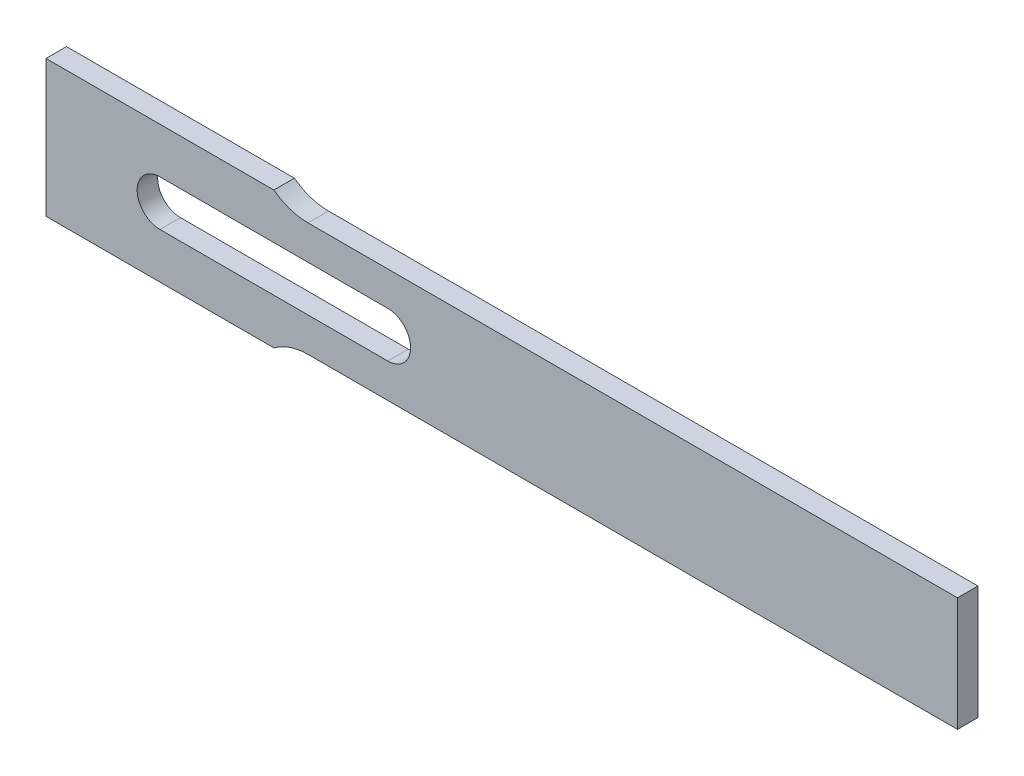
ISO-10303-21;
HEADER;
FILE_DESCRIPTION(('STEP AP214'),'2;1');
FILE_NAME('part.step','',(''),(''),'','','');
FILE_SCHEMA(('AUTOMOTIVE_DESIGN { 1 0 10303 214 1 1 1 1 }'));
ENDSEC;
DATA;
#1=APPLICATION_CONTEXT('core data for automotive mechanical design processes');
#2=APPLICATION_PROTOCOL_DEFINITION('international standard','automotive_design',2000,#1);
#3=PRODUCT_CONTEXT('',#1,'mechanical');
#4=PRODUCT('Part','Part','',(#3));
#5=PRODUCT_RELATED_PRODUCT_CATEGORY('part','',(#4));
#6=PRODUCT_DEFINITION_FORMATION('','',#4);
#7=PRODUCT_DEFINITION_CONTEXT('part definition',#1,'design');
#8=PRODUCT_DEFINITION('design','',#6,#7);
#9=PRODUCT_DEFINITION_SHAPE('','',#8);
#10=(LENGTH_UNIT() NAMED_UNIT(*) SI_UNIT(.MILLI.,.METRE.));
#11=(NAMED_UNIT(*) PLANE_ANGLE_UNIT() SI_UNIT($,.RADIAN.));
#12=(NAMED_UNIT(*) SI_UNIT($,.STERADIAN.) SOLID_ANGLE_UNIT());
#13=UNCERTAINTY_MEASURE_WITH_UNIT(LENGTH_MEASURE(1.E-05),#10,'distance_accuracy_value','');
#14=(GEOMETRIC_REPRESENTATION_CONTEXT(3) GLOBAL_UNCERTAINTY_ASSIGNED_CONTEXT((#13)) GLOBAL_UNIT_ASSIGNED_CONTEXT((#10,
#11,#12)) REPRESENTATION_CONTEXT('',''));
#15=CARTESIAN_POINT('',(0.,0.,0.));
#16=DIRECTION('',(0.,0.,1.));
#17=DIRECTION('',(1.,0.,0.));
#18=AXIS2_PLACEMENT_3D('',#15,#16,#17);
#19=CARTESIAN_POINT('',(23.,9.99999999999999,1.8));
#20=DIRECTION('',(0.,0.,1.));
#21=DIRECTION('',(1.,0.,0.));
#22=AXIS2_PLACEMENT_3D('',#19,#20,#21);
#23=PLANE('',#22);
#24=DIRECTION('',(0.,-1.,0.));
#25=VECTOR('',#24,1.);
#26=CARTESIAN_POINT('',(0.,-6.,1.8));
#27=LINE('',#26,#25);
#28=CARTESIAN_POINT('',(0.,6.,1.8));
#29=VERTEX_POINT('',#28);
#30=CARTESIAN_POINT('',(0.,-6.,1.8));
#31=VERTEX_POINT('',#30);
#32=EDGE_CURVE('E156',#29,#31,#27,.T.);
#33=ORIENTED_EDGE('',*,*,#32,.T.);
#34=DIRECTION('',(1.,0.,0.));
#35=VECTOR('',#34,1.);
#36=CARTESIAN_POINT('',(0.,-6.,1.8));
#37=LINE('',#36,#35);
#38=CARTESIAN_POINT('',(20.,-6.,1.8));
#39=VERTEX_POINT('',#38);
#40=EDGE_CURVE('E159',#31,#39,#37,.T.);
#41=ORIENTED_EDGE('',*,*,#40,.T.);
#42=CARTESIAN_POINT('',(23.,-9.99999999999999,1.8));
#43=DIRECTION('',(0.,0.,-1.));
#44=DIRECTION('',(1.,0.,0.));
#45=AXIS2_PLACEMENT_3D('',#42,#43,#44);
#46=CIRCLE('',#45,4.99999999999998);
#47=CARTESIAN_POINT('',(23.,-5.00000000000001,1.8));
#48=VERTEX_POINT('',#47);
#49=EDGE_CURVE('E162',#39,#48,#46,.T.);
#50=ORIENTED_EDGE('',*,*,#49,.T.);
#51=DIRECTION('',(1.,0.,0.));
#52=VECTOR('',#51,1.);
#53=CARTESIAN_POINT('',(80.,-5.00000000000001,1.8));
#54=LINE('',#53,#52);
#55=CARTESIAN_POINT('',(80.,-5.00000000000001,1.8));
#56=VERTEX_POINT('',#55);
#57=EDGE_CURVE('E164',#48,#56,#54,.T.);
#58=ORIENTED_EDGE('',*,*,#57,.T.);
#59=DIRECTION('',(0.,1.,0.));
#60=VECTOR('',#59,1.);
#61=CARTESIAN_POINT('',(80.,-5.00000000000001,1.8));
#62=LINE('',#61,#60);
#63=CARTESIAN_POINT('',(80.,4.99999999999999,1.8));
#64=VERTEX_POINT('',#63);
#65=EDGE_CURVE('E166',#56,#64,#62,.T.);
#66=ORIENTED_EDGE('',*,*,#65,.T.);
#67=DIRECTION('',(-1.,0.,0.));
#68=VECTOR('',#67,1.);
#69=CARTESIAN_POINT('',(80.,4.99999999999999,1.8));
#70=LINE('',#69,#68);
#71=CARTESIAN_POINT('',(23.,4.99999999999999,1.8));
#72=VERTEX_POINT('',#71);
#73=EDGE_CURVE('E168',#64,#72,#70,.T.);
#74=ORIENTED_EDGE('',*,*,#73,.T.);
#75=CARTESIAN_POINT('',(23.,9.99999999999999,1.8));
#76=DIRECTION('',(0.,0.,-1.));
#77=DIRECTION('',(1.,0.,0.));
#78=AXIS2_PLACEMENT_3D('',#75,#76,#77);
#79=CIRCLE('',#78,5.);
#80=CARTESIAN_POINT('',(20.,6.,1.8));
#81=VERTEX_POINT('',#80);
#82=EDGE_CURVE('E170',#72,#81,#79,.T.);
#83=ORIENTED_EDGE('',*,*,#82,.T.);
#84=DIRECTION('',(-1.,0.,0.));
#85=VECTOR('',#84,1.);
#86=CARTESIAN_POINT('',(0.,6.,1.8));
#87=LINE('',#86,#85);
#88=EDGE_CURVE('E172',#81,#29,#87,.T.);
#89=ORIENTED_EDGE('',*,*,#88,.T.);
#90=EDGE_LOOP('',(#33,#41,#50,#58,#66,#74,#83,#89));
#91=FACE_BOUND('',#90,.T.);
#92=DIRECTION('',(1.,0.,0.));
#93=VECTOR('',#92,1.);
#94=CARTESIAN_POINT('',(10.,-2.,1.8));
#95=LINE('',#94,#93);
#96=CARTESIAN_POINT('',(10.,-2.,1.8));
#97=VERTEX_POINT('',#96);
#98=CARTESIAN_POINT('',(30.,-2.,1.8));
#99=VERTEX_POINT('',#98);
#100=EDGE_CURVE('E128',#97,#99,#95,.T.);
#101=ORIENTED_EDGE('',*,*,#100,.F.);
#102=CARTESIAN_POINT('',(10.,0.,1.8));
#103=DIRECTION('',(0.,0.,1.));
#104=DIRECTION('',(1.,0.,0.));
#105=AXIS2_PLACEMENT_3D('',#102,#103,#104);
#106=CIRCLE('',#105,2.);
#107=CARTESIAN_POINT('',(10.,2.,1.8));
#108=VERTEX_POINT('',#107);
#109=EDGE_CURVE('E120',#108,#97,#106,.T.);
#110=ORIENTED_EDGE('',*,*,#109,.F.);
#111=DIRECTION('',(-1.,0.,0.));
#112=VECTOR('',#111,1.);
#113=CARTESIAN_POINT('',(10.,2.,1.8));
#114=LINE('',#113,#112);
#115=CARTESIAN_POINT('',(30.,2.,1.8));
#116=VERTEX_POINT('',#115);
#117=EDGE_CURVE('E142',#116,#108,#114,.T.);
#118=ORIENTED_EDGE('',*,*,#117,.F.);
#119=CARTESIAN_POINT('',(30.,0.,1.8));
#120=DIRECTION('',(0.,0.,1.));
#121=DIRECTION('',(1.,0.,0.));
#122=AXIS2_PLACEMENT_3D('',#119,#120,#121);
#123=CIRCLE('',#122,2.);
#124=EDGE_CURVE('E140',#99,#116,#123,.T.);
#125=ORIENTED_EDGE('',*,*,#124,.F.);
#126=EDGE_LOOP('',(#101,#110,#118,#125));
#127=FACE_BOUND('',#126,.T.);
#128=ADVANCED_FACE('F31',(#91,#127),#23,.T.);
#129=CARTESIAN_POINT('',(23.,9.99999999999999,0.));
#130=DIRECTION('',(0.,0.,1.));
#131=DIRECTION('',(1.,0.,0.));
#132=AXIS2_PLACEMENT_3D('',#129,#130,#131);
#133=PLANE('',#132);
#134=DIRECTION('',(0.,-1.,0.));
#135=VECTOR('',#134,1.);
#136=CARTESIAN_POINT('',(0.,-6.,0.));
#137=LINE('',#136,#135);
#138=CARTESIAN_POINT('',(0.,6.,0.));
#139=VERTEX_POINT('',#138);
#140=CARTESIAN_POINT('',(0.,-6.,0.));
#141=VERTEX_POINT('',#140);
#142=EDGE_CURVE('E136',#139,#141,#137,.T.);
#143=ORIENTED_EDGE('',*,*,#142,.F.);
#144=DIRECTION('',(-1.,0.,0.));
#145=VECTOR('',#144,1.);
#146=CARTESIAN_POINT('',(0.,6.,0.));
#147=LINE('',#146,#145);
#148=CARTESIAN_POINT('',(20.,6.,0.));
#149=VERTEX_POINT('',#148);
#150=EDGE_CURVE('E160',#149,#139,#147,.T.);
#151=ORIENTED_EDGE('',*,*,#150,.F.);
#152=CARTESIAN_POINT('',(23.,9.99999999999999,0.));
#153=DIRECTION('',(0.,0.,-1.));
#154=DIRECTION('',(1.,0.,0.));
#155=AXIS2_PLACEMENT_3D('',#152,#153,#154);
#156=CIRCLE('',#155,5.);
#157=CARTESIAN_POINT('',(23.,4.99999999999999,0.));
#158=VERTEX_POINT('',#157);
#159=EDGE_CURVE('E187',#158,#149,#156,.T.);
#160=ORIENTED_EDGE('',*,*,#159,.F.);
#161=DIRECTION('',(-1.,0.,0.));
#162=VECTOR('',#161,1.);
#163=CARTESIAN_POINT('',(80.,4.99999999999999,0.));
#164=LINE('',#163,#162);
#165=CARTESIAN_POINT('',(80.,4.99999999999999,0.));
#166=VERTEX_POINT('',#165);
#167=EDGE_CURVE('E185',#166,#158,#164,.T.);
#168=ORIENTED_EDGE('',*,*,#167,.F.);
#169=DIRECTION('',(0.,1.,0.));
#170=VECTOR('',#169,1.);
#171=CARTESIAN_POINT('',(80.,-5.00000000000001,0.));
#172=LINE('',#171,#170);
#173=CARTESIAN_POINT('',(80.,-5.00000000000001,0.));
#174=VERTEX_POINT('',#173);
#175=EDGE_CURVE('E183',#174,#166,#172,.T.);
#176=ORIENTED_EDGE('',*,*,#175,.F.);
#177=DIRECTION('',(1.,0.,0.));
#178=VECTOR('',#177,1.);
#179=CARTESIAN_POINT('',(80.,-5.00000000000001,0.));
#180=LINE('',#179,#178);
#181=CARTESIAN_POINT('',(23.,-5.00000000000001,0.));
#182=VERTEX_POINT('',#181);
#183=EDGE_CURVE('E181',#182,#174,#180,.T.);
#184=ORIENTED_EDGE('',*,*,#183,.F.);
#185=CARTESIAN_POINT('',(23.,-9.99999999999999,0.));
#186=DIRECTION('',(0.,0.,-1.));
#187=DIRECTION('',(1.,0.,0.));
#188=AXIS2_PLACEMENT_3D('',#185,#186,#187);
#189=CIRCLE('',#188,4.99999999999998);
#190=CARTESIAN_POINT('',(20.,-6.,0.));
#191=VERTEX_POINT('',#190);
#192=EDGE_CURVE('E179',#191,#182,#189,.T.);
#193=ORIENTED_EDGE('',*,*,#192,.F.);
#194=DIRECTION('',(1.,0.,0.));
#195=VECTOR('',#194,1.);
#196=CARTESIAN_POINT('',(0.,-6.,0.));
#197=LINE('',#196,#195);
#198=EDGE_CURVE('E177',#141,#191,#197,.T.);
#199=ORIENTED_EDGE('',*,*,#198,.F.);
#200=EDGE_LOOP('',(#143,#151,#160,#168,#176,#184,#193,#199));
#201=FACE_BOUND('',#200,.T.);
#202=CARTESIAN_POINT('',(10.,0.,0.));
#203=DIRECTION('',(0.,0.,1.));
#204=DIRECTION('',(1.,0.,0.));
#205=AXIS2_PLACEMENT_3D('',#202,#203,#204);
#206=CIRCLE('',#205,2.);
#207=CARTESIAN_POINT('',(10.,2.,0.));
#208=VERTEX_POINT('',#207);
#209=CARTESIAN_POINT('',(10.,-2.,0.));
#210=VERTEX_POINT('',#209);
#211=EDGE_CURVE('E54',#208,#210,#206,.T.);
#212=ORIENTED_EDGE('',*,*,#211,.T.);
#213=DIRECTION('',(1.,0.,0.));
#214=VECTOR('',#213,1.);
#215=CARTESIAN_POINT('',(10.,-2.,0.));
#216=LINE('',#215,#214);
#217=CARTESIAN_POINT('',(30.,-2.,0.));
#218=VERTEX_POINT('',#217);
#219=EDGE_CURVE('E135',#210,#218,#216,.T.);
#220=ORIENTED_EDGE('',*,*,#219,.T.);
#221=CARTESIAN_POINT('',(30.,0.,0.));
#222=DIRECTION('',(0.,0.,1.));
#223=DIRECTION('',(1.,0.,0.));
#224=AXIS2_PLACEMENT_3D('',#221,#222,#223);
#225=CIRCLE('',#224,2.);
#226=CARTESIAN_POINT('',(30.,2.,0.));
#227=VERTEX_POINT('',#226);
#228=EDGE_CURVE('E148',#218,#227,#225,.T.);
#229=ORIENTED_EDGE('',*,*,#228,.T.);
#230=DIRECTION('',(-1.,0.,0.));
#231=VECTOR('',#230,1.);
#232=CARTESIAN_POINT('',(10.,2.,0.));
#233=LINE('',#232,#231);
#234=EDGE_CURVE('E129',#227,#208,#233,.T.);
#235=ORIENTED_EDGE('',*,*,#234,.T.);
#236=EDGE_LOOP('',(#212,#220,#229,#235));
#237=FACE_BOUND('',#236,.T.);
#238=ADVANCED_FACE('F217',(#201,#237),#133,.F.);
#239=CARTESIAN_POINT('',(0.,-6.,1.8));
#240=DIRECTION('',(1.,0.,0.));
#241=DIRECTION('',(0.,0.,-1.));
#242=AXIS2_PLACEMENT_3D('',#239,#240,#241);
#243=PLANE('',#242);
#244=ORIENTED_EDGE('',*,*,#142,.T.);
#245=DIRECTION('',(0.,0.,-1.));
#246=VECTOR('',#245,1.);
#247=CARTESIAN_POINT('',(0.,-6.,1.8));
#248=LINE('',#247,#246);
#249=EDGE_CURVE('E11',#31,#141,#248,.T.);
#250=ORIENTED_EDGE('',*,*,#249,.F.);
#251=ORIENTED_EDGE('',*,*,#32,.F.);
#252=DIRECTION('',(0.,0.,-1.));
#253=VECTOR('',#252,1.);
#254=CARTESIAN_POINT('',(0.,6.,1.8));
#255=LINE('',#254,#253);
#256=EDGE_CURVE('E174',#29,#139,#255,.T.);
#257=ORIENTED_EDGE('',*,*,#256,.T.);
#258=EDGE_LOOP('',(#244,#250,#251,#257));
#259=FACE_BOUND('',#258,.T.);
#260=ADVANCED_FACE('F33',(#259),#243,.F.);
#261=CARTESIAN_POINT('',(0.,-6.,1.8));
#262=DIRECTION('',(0.,1.,0.));
#263=DIRECTION('',(0.,0.,1.));
#264=AXIS2_PLACEMENT_3D('',#261,#262,#263);
#265=PLANE('',#264);
#266=ORIENTED_EDGE('',*,*,#198,.T.);
#267=DIRECTION('',(0.,0.,-1.));
#268=VECTOR('',#267,1.);
#269=CARTESIAN_POINT('',(20.,-6.,1.8));
#270=LINE('',#269,#268);
#271=EDGE_CURVE('E39',#39,#191,#270,.T.);
#272=ORIENTED_EDGE('',*,*,#271,.F.);
#273=ORIENTED_EDGE('',*,*,#40,.F.);
#274=ORIENTED_EDGE('',*,*,#249,.T.);
#275=EDGE_LOOP('',(#266,#272,#273,#274));
#276=FACE_BOUND('',#275,.T.);
#277=ADVANCED_FACE('F234',(#276),#265,.F.);
#278=CARTESIAN_POINT('',(23.,-9.99999999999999,1.8));
#279=DIRECTION('',(0.,0.,-1.));
#280=DIRECTION('',(-1.,0.,0.));
#281=AXIS2_PLACEMENT_3D('',#278,#279,#280);
#282=CYLINDRICAL_SURFACE('',#281,4.99999999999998);
#283=ORIENTED_EDGE('',*,*,#192,.T.);
#284=DIRECTION('',(0.,0.,-1.));
#285=VECTOR('',#284,1.);
#286=CARTESIAN_POINT('',(23.,-5.00000000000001,1.8));
#287=LINE('',#286,#285);
#288=EDGE_CURVE('E204',#48,#182,#287,.T.);
#289=ORIENTED_EDGE('',*,*,#288,.F.);
#290=ORIENTED_EDGE('',*,*,#49,.F.);
#291=ORIENTED_EDGE('',*,*,#271,.T.);
#292=EDGE_LOOP('',(#283,#289,#290,#291));
#293=FACE_BOUND('',#292,.T.);
#294=ADVANCED_FACE('F211',(#293),#282,.F.);
#295=CARTESIAN_POINT('',(80.,-5.00000000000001,1.8));
#296=DIRECTION('',(0.,1.,0.));
#297=DIRECTION('',(-1.,0.,0.));
#298=AXIS2_PLACEMENT_3D('',#295,#296,#297);
#299=PLANE('',#298);
#300=ORIENTED_EDGE('',*,*,#183,.T.);
#301=DIRECTION('',(0.,0.,-1.));
#302=VECTOR('',#301,1.);
#303=CARTESIAN_POINT('',(80.,-5.00000000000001,1.8));
#304=LINE('',#303,#302);
#305=EDGE_CURVE('E201',#56,#174,#304,.T.);
#306=ORIENTED_EDGE('',*,*,#305,.F.);
#307=ORIENTED_EDGE('',*,*,#57,.F.);
#308=ORIENTED_EDGE('',*,*,#288,.T.);
#309=EDGE_LOOP('',(#300,#306,#307,#308));
#310=FACE_BOUND('',#309,.T.);
#311=ADVANCED_FACE('F223',(#310),#299,.F.);
#312=CARTESIAN_POINT('',(80.,-5.00000000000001,1.8));
#313=DIRECTION('',(-1.,0.,0.));
#314=DIRECTION('',(0.,0.,1.));
#315=AXIS2_PLACEMENT_3D('',#312,#313,#314);
#316=PLANE('',#315);
#317=ORIENTED_EDGE('',*,*,#175,.T.);
#318=DIRECTION('',(0.,0.,-1.));
#319=VECTOR('',#318,1.);
#320=CARTESIAN_POINT('',(80.,4.99999999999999,1.8));
#321=LINE('',#320,#319);
#322=EDGE_CURVE('E198',#64,#166,#321,.T.);
#323=ORIENTED_EDGE('',*,*,#322,.F.);
#324=ORIENTED_EDGE('',*,*,#65,.F.);
#325=ORIENTED_EDGE('',*,*,#305,.T.);
#326=EDGE_LOOP('',(#317,#323,#324,#325));
#327=FACE_BOUND('',#326,.T.);
#328=ADVANCED_FACE('F227',(#327),#316,.F.);
#329=CARTESIAN_POINT('',(80.,4.99999999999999,1.8));
#330=DIRECTION('',(0.,-1.,0.));
#331=DIRECTION('',(1.,0.,0.));
#332=AXIS2_PLACEMENT_3D('',#329,#330,#331);
#333=PLANE('',#332);
#334=ORIENTED_EDGE('',*,*,#167,.T.);
#335=DIRECTION('',(0.,0.,-1.));
#336=VECTOR('',#335,1.);
#337=CARTESIAN_POINT('',(23.,4.99999999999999,1.8));
#338=LINE('',#337,#336);
#339=EDGE_CURVE('E195',#72,#158,#338,.T.);
#340=ORIENTED_EDGE('',*,*,#339,.F.);
#341=ORIENTED_EDGE('',*,*,#73,.F.);
#342=ORIENTED_EDGE('',*,*,#322,.T.);
#343=EDGE_LOOP('',(#334,#340,#341,#342));
#344=FACE_BOUND('',#343,.T.);
#345=ADVANCED_FACE('F247',(#344),#333,.F.);
#346=CARTESIAN_POINT('',(23.,9.99999999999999,1.8));
#347=DIRECTION('',(0.,0.,-1.));
#348=DIRECTION('',(-1.,0.,0.));
#349=AXIS2_PLACEMENT_3D('',#346,#347,#348);
#350=CYLINDRICAL_SURFACE('',#349,5.);
#351=ORIENTED_EDGE('',*,*,#159,.T.);
#352=DIRECTION('',(0.,0.,-1.));
#353=VECTOR('',#352,1.);
#354=CARTESIAN_POINT('',(20.,6.,1.8));
#355=LINE('',#354,#353);
#356=EDGE_CURVE('E192',#81,#149,#355,.T.);
#357=ORIENTED_EDGE('',*,*,#356,.F.);
#358=ORIENTED_EDGE('',*,*,#82,.F.);
#359=ORIENTED_EDGE('',*,*,#339,.T.);
#360=EDGE_LOOP('',(#351,#357,#358,#359));
#361=FACE_BOUND('',#360,.T.);
#362=ADVANCED_FACE('F245',(#361),#350,.F.);
#363=CARTESIAN_POINT('',(0.,6.,1.8));
#364=DIRECTION('',(0.,-1.,0.));
#365=DIRECTION('',(0.,0.,-1.));
#366=AXIS2_PLACEMENT_3D('',#363,#364,#365);
#367=PLANE('',#366);
#368=ORIENTED_EDGE('',*,*,#150,.T.);
#369=ORIENTED_EDGE('',*,*,#256,.F.);
#370=ORIENTED_EDGE('',*,*,#88,.F.);
#371=ORIENTED_EDGE('',*,*,#356,.T.);
#372=EDGE_LOOP('',(#368,#369,#370,#371));
#373=FACE_BOUND('',#372,.T.);
#374=ADVANCED_FACE('F240',(#373),#367,.F.);
#375=CARTESIAN_POINT('',(10.,0.,1.8));
#376=DIRECTION('',(0.,0.,-1.));
#377=DIRECTION('',(-1.,0.,0.));
#378=AXIS2_PLACEMENT_3D('',#375,#376,#377);
#379=CYLINDRICAL_SURFACE('',#378,2.);
#380=ORIENTED_EDGE('',*,*,#211,.F.);
#381=DIRECTION('',(0.,0.,-1.));
#382=VECTOR('',#381,1.);
#383=CARTESIAN_POINT('',(10.,2.,1.8));
#384=LINE('',#383,#382);
#385=EDGE_CURVE('E124',#108,#208,#384,.T.);
#386=ORIENTED_EDGE('',*,*,#385,.F.);
#387=ORIENTED_EDGE('',*,*,#109,.T.);
#388=DIRECTION('',(0.,0.,-1.));
#389=VECTOR('',#388,1.);
#390=CARTESIAN_POINT('',(10.,-2.,1.8));
#391=LINE('',#390,#389);
#392=EDGE_CURVE('E123',#97,#210,#391,.T.);
#393=ORIENTED_EDGE('',*,*,#392,.T.);
#394=EDGE_LOOP('',(#380,#386,#387,#393));
#395=FACE_BOUND('',#394,.T.);
#396=ADVANCED_FACE('F122',(#395),#379,.F.);
#397=CARTESIAN_POINT('',(10.,-2.,1.8));
#398=DIRECTION('',(0.,1.,0.));
#399=DIRECTION('',(-1.,0.,0.));
#400=AXIS2_PLACEMENT_3D('',#397,#398,#399);
#401=PLANE('',#400);
#402=ORIENTED_EDGE('',*,*,#219,.F.);
#403=ORIENTED_EDGE('',*,*,#392,.F.);
#404=ORIENTED_EDGE('',*,*,#100,.T.);
#405=DIRECTION('',(0.,0.,-1.));
#406=VECTOR('',#405,1.);
#407=CARTESIAN_POINT('',(30.,-2.,1.8));
#408=LINE('',#407,#406);
#409=EDGE_CURVE('E137',#99,#218,#408,.T.);
#410=ORIENTED_EDGE('',*,*,#409,.T.);
#411=EDGE_LOOP('',(#402,#403,#404,#410));
#412=FACE_BOUND('',#411,.T.);
#413=ADVANCED_FACE('F132',(#412),#401,.T.);
#414=CARTESIAN_POINT('',(30.,0.,1.8));
#415=DIRECTION('',(0.,0.,-1.));
#416=DIRECTION('',(-1.,0.,0.));
#417=AXIS2_PLACEMENT_3D('',#414,#415,#416);
#418=CYLINDRICAL_SURFACE('',#417,2.);
#419=ORIENTED_EDGE('',*,*,#228,.F.);
#420=ORIENTED_EDGE('',*,*,#409,.F.);
#421=ORIENTED_EDGE('',*,*,#124,.T.);
#422=DIRECTION('',(0.,0.,-1.));
#423=VECTOR('',#422,1.);
#424=CARTESIAN_POINT('',(30.,2.,1.8));
#425=LINE('',#424,#423);
#426=EDGE_CURVE('E46',#116,#227,#425,.T.);
#427=ORIENTED_EDGE('',*,*,#426,.T.);
#428=EDGE_LOOP('',(#419,#420,#421,#427));
#429=FACE_BOUND('',#428,.T.);
#430=ADVANCED_FACE('F272',(#429),#418,.F.);
#431=CARTESIAN_POINT('',(10.,2.,1.8));
#432=DIRECTION('',(0.,-1.,0.));
#433=DIRECTION('',(0.,0.,-1.));
#434=AXIS2_PLACEMENT_3D('',#431,#432,#433);
#435=PLANE('',#434);
#436=ORIENTED_EDGE('',*,*,#234,.F.);
#437=ORIENTED_EDGE('',*,*,#426,.F.);
#438=ORIENTED_EDGE('',*,*,#117,.T.);
#439=ORIENTED_EDGE('',*,*,#385,.T.);
#440=EDGE_LOOP('',(#436,#437,#438,#439));
#441=FACE_BOUND('',#440,.T.);
#442=ADVANCED_FACE('F276',(#441),#435,.T.);
#443=CLOSED_SHELL('',(#128,#238,#260,#277,#294,#311,#328,#345,#362,#374,#396,#413,#430,#442));
#444=MANIFOLD_SOLID_BREP('B2',#443);
#445=ADVANCED_BREP_SHAPE_REPRESENTATION('',(#18,#444),#14);
#446=SHAPE_DEFINITION_REPRESENTATION(#9,#445);
ENDSEC;
END-ISO-10303-21;
